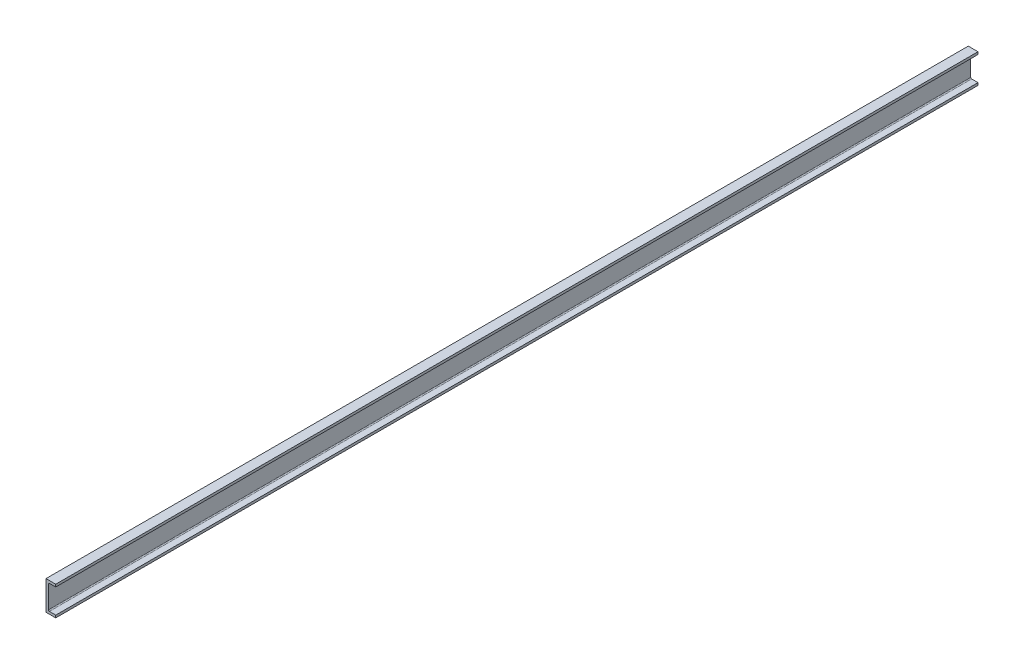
ISO-10303-21;
HEADER;
FILE_DESCRIPTION(('STEP AP214'),'2;1');
FILE_NAME('part.step','',(''),(''),'','','');
FILE_SCHEMA(('AUTOMOTIVE_DESIGN { 1 0 10303 214 1 1 1 1 }'));
ENDSEC;
DATA;
#1=APPLICATION_CONTEXT('core data for automotive mechanical design processes');
#2=APPLICATION_PROTOCOL_DEFINITION('international standard','automotive_design',2000,#1);
#3=PRODUCT_CONTEXT('',#1,'mechanical');
#4=PRODUCT('Part','Part','',(#3));
#5=PRODUCT_RELATED_PRODUCT_CATEGORY('part','',(#4));
#6=PRODUCT_DEFINITION_FORMATION('','',#4);
#7=PRODUCT_DEFINITION_CONTEXT('part definition',#1,'design');
#8=PRODUCT_DEFINITION('design','',#6,#7);
#9=PRODUCT_DEFINITION_SHAPE('','',#8);
#10=(LENGTH_UNIT() NAMED_UNIT(*) SI_UNIT(.MILLI.,.METRE.));
#11=(NAMED_UNIT(*) PLANE_ANGLE_UNIT() SI_UNIT($,.RADIAN.));
#12=(NAMED_UNIT(*) SI_UNIT($,.STERADIAN.) SOLID_ANGLE_UNIT());
#13=UNCERTAINTY_MEASURE_WITH_UNIT(LENGTH_MEASURE(1.E-05),#10,'distance_accuracy_value','');
#14=(GEOMETRIC_REPRESENTATION_CONTEXT(3) GLOBAL_UNCERTAINTY_ASSIGNED_CONTEXT((#13)) GLOBAL_UNIT_ASSIGNED_CONTEXT((#10,
#11,#12)) REPRESENTATION_CONTEXT('',''));
#15=CARTESIAN_POINT('',(0.,0.,0.));
#16=DIRECTION('',(0.,0.,1.));
#17=DIRECTION('',(1.,0.,0.));
#18=AXIS2_PLACEMENT_3D('',#15,#16,#17);
#19=CARTESIAN_POINT('',(25.4,0.,-2406.65));
#20=DIRECTION('',(0.,-1.,0.));
#21=DIRECTION('',(1.,0.,0.));
#22=AXIS2_PLACEMENT_3D('',#19,#20,#21);
#23=PLANE('',#22);
#24=DIRECTION('',(1.,0.,0.));
#25=VECTOR('',#24,1.);
#26=CARTESIAN_POINT('',(25.4,0.,0.));
#27=LINE('',#26,#25);
#28=CARTESIAN_POINT('',(0.,0.,0.));
#29=VERTEX_POINT('',#28);
#30=CARTESIAN_POINT('',(25.4,0.,0.));
#31=VERTEX_POINT('',#30);
#32=EDGE_CURVE('E150',#29,#31,#27,.T.);
#33=ORIENTED_EDGE('',*,*,#32,.F.);
#34=DIRECTION('',(0.,0.,1.));
#35=VECTOR('',#34,1.);
#36=CARTESIAN_POINT('',(0.,0.,-2406.65));
#37=LINE('',#36,#35);
#38=CARTESIAN_POINT('',(0.,0.,-2406.65));
#39=VERTEX_POINT('',#38);
#40=EDGE_CURVE('E130',#39,#29,#37,.T.);
#41=ORIENTED_EDGE('',*,*,#40,.F.);
#42=DIRECTION('',(1.,0.,0.));
#43=VECTOR('',#42,1.);
#44=CARTESIAN_POINT('',(25.4,0.,-2406.65));
#45=LINE('',#44,#43);
#46=CARTESIAN_POINT('',(25.4,0.,-2406.65));
#47=VERTEX_POINT('',#46);
#48=EDGE_CURVE('E125',#39,#47,#45,.T.);
#49=ORIENTED_EDGE('',*,*,#48,.T.);
#50=DIRECTION('',(0.,0.,1.));
#51=VECTOR('',#50,1.);
#52=CARTESIAN_POINT('',(25.4,0.,-2406.65));
#53=LINE('',#52,#51);
#54=EDGE_CURVE('E107',#47,#31,#53,.T.);
#55=ORIENTED_EDGE('',*,*,#54,.T.);
#56=EDGE_LOOP('',(#33,#41,#49,#55));
#57=FACE_BOUND('',#56,.T.);
#58=ADVANCED_FACE('F32',(#57),#23,.T.);
#59=CARTESIAN_POINT('',(0.,0.,-2406.65));
#60=DIRECTION('',(-1.,0.,0.));
#61=DIRECTION('',(0.,0.,1.));
#62=AXIS2_PLACEMENT_3D('',#59,#60,#61);
#63=PLANE('',#62);
#64=DIRECTION('',(0.,-1.,0.));
#65=VECTOR('',#64,1.);
#66=CARTESIAN_POINT('',(0.,0.,0.));
#67=LINE('',#66,#65);
#68=CARTESIAN_POINT('',(0.,76.2,0.));
#69=VERTEX_POINT('',#68);
#70=EDGE_CURVE('E131',#69,#29,#67,.T.);
#71=ORIENTED_EDGE('',*,*,#70,.F.);
#72=DIRECTION('',(0.,0.,1.));
#73=VECTOR('',#72,1.);
#74=CARTESIAN_POINT('',(0.,76.2,-2406.65));
#75=LINE('',#74,#73);
#76=CARTESIAN_POINT('',(0.,76.2,-2406.65));
#77=VERTEX_POINT('',#76);
#78=EDGE_CURVE('E167',#77,#69,#75,.T.);
#79=ORIENTED_EDGE('',*,*,#78,.F.);
#80=DIRECTION('',(0.,-1.,0.));
#81=VECTOR('',#80,1.);
#82=CARTESIAN_POINT('',(0.,0.,-2406.65));
#83=LINE('',#82,#81);
#84=EDGE_CURVE('E118',#77,#39,#83,.T.);
#85=ORIENTED_EDGE('',*,*,#84,.T.);
#86=ORIENTED_EDGE('',*,*,#40,.T.);
#87=EDGE_LOOP('',(#71,#79,#85,#86));
#88=FACE_BOUND('',#87,.T.);
#89=ADVANCED_FACE('F213',(#88),#63,.T.);
#90=CARTESIAN_POINT('',(0.,76.2,-2406.65));
#91=DIRECTION('',(0.,1.,0.));
#92=DIRECTION('',(0.,0.,1.));
#93=AXIS2_PLACEMENT_3D('',#90,#91,#92);
#94=PLANE('',#93);
#95=DIRECTION('',(-1.,0.,0.));
#96=VECTOR('',#95,1.);
#97=CARTESIAN_POINT('',(0.,76.2,0.));
#98=LINE('',#97,#96);
#99=CARTESIAN_POINT('',(25.4,76.2,0.));
#100=VERTEX_POINT('',#99);
#101=EDGE_CURVE('E134',#100,#69,#98,.T.);
#102=ORIENTED_EDGE('',*,*,#101,.F.);
#103=DIRECTION('',(0.,0.,1.));
#104=VECTOR('',#103,1.);
#105=CARTESIAN_POINT('',(25.4,76.2,-2406.65));
#106=LINE('',#105,#104);
#107=CARTESIAN_POINT('',(25.4,76.2,-2406.65));
#108=VERTEX_POINT('',#107);
#109=EDGE_CURVE('E169',#108,#100,#106,.T.);
#110=ORIENTED_EDGE('',*,*,#109,.F.);
#111=DIRECTION('',(-1.,0.,0.));
#112=VECTOR('',#111,1.);
#113=CARTESIAN_POINT('',(0.,76.2,-2406.65));
#114=LINE('',#113,#112);
#115=EDGE_CURVE('E146',#108,#77,#114,.T.);
#116=ORIENTED_EDGE('',*,*,#115,.T.);
#117=ORIENTED_EDGE('',*,*,#78,.T.);
#118=EDGE_LOOP('',(#102,#110,#116,#117));
#119=FACE_BOUND('',#118,.T.);
#120=ADVANCED_FACE('F214',(#119),#94,.T.);
#121=CARTESIAN_POINT('',(25.4,76.2,-2406.65));
#122=DIRECTION('',(1.,0.,0.));
#123=DIRECTION('',(0.,1.,0.));
#124=AXIS2_PLACEMENT_3D('',#121,#122,#123);
#125=PLANE('',#124);
#126=DIRECTION('',(0.,1.,0.));
#127=VECTOR('',#126,1.);
#128=CARTESIAN_POINT('',(25.4,76.2,0.));
#129=LINE('',#128,#127);
#130=CARTESIAN_POINT('',(25.4,69.85,0.));
#131=VERTEX_POINT('',#130);
#132=EDGE_CURVE('E160',#131,#100,#129,.T.);
#133=ORIENTED_EDGE('',*,*,#132,.F.);
#134=DIRECTION('',(0.,0.,1.));
#135=VECTOR('',#134,1.);
#136=CARTESIAN_POINT('',(25.4,69.85,-2406.65));
#137=LINE('',#136,#135);
#138=CARTESIAN_POINT('',(25.4,69.85,-2406.65));
#139=VERTEX_POINT('',#138);
#140=EDGE_CURVE('E171',#139,#131,#137,.T.);
#141=ORIENTED_EDGE('',*,*,#140,.F.);
#142=DIRECTION('',(0.,1.,0.));
#143=VECTOR('',#142,1.);
#144=CARTESIAN_POINT('',(25.4,76.2,-2406.65));
#145=LINE('',#144,#143);
#146=EDGE_CURVE('E143',#139,#108,#145,.T.);
#147=ORIENTED_EDGE('',*,*,#146,.T.);
#148=ORIENTED_EDGE('',*,*,#109,.T.);
#149=EDGE_LOOP('',(#133,#141,#147,#148));
#150=FACE_BOUND('',#149,.T.);
#151=ADVANCED_FACE('F208',(#150),#125,.T.);
#152=CARTESIAN_POINT('',(25.4,69.85,-2406.65));
#153=DIRECTION('',(0.,-1.,0.));
#154=DIRECTION('',(0.,0.,-1.));
#155=AXIS2_PLACEMENT_3D('',#152,#153,#154);
#156=PLANE('',#155);
#157=DIRECTION('',(1.,0.,0.));
#158=VECTOR('',#157,1.);
#159=CARTESIAN_POINT('',(25.4,69.85,0.));
#160=LINE('',#159,#158);
#161=CARTESIAN_POINT('',(8.88999999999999,69.85,0.));
#162=VERTEX_POINT('',#161);
#163=EDGE_CURVE('E158',#162,#131,#160,.T.);
#164=ORIENTED_EDGE('',*,*,#163,.F.);
#165=DIRECTION('',(0.,0.,1.));
#166=VECTOR('',#165,1.);
#167=CARTESIAN_POINT('',(8.88999999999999,69.85,-2406.65));
#168=LINE('',#167,#166);
#169=CARTESIAN_POINT('',(8.88999999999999,69.85,-2406.65));
#170=VERTEX_POINT('',#169);
#171=EDGE_CURVE('E47',#162,#170,#168,.F.);
#172=ORIENTED_EDGE('',*,*,#171,.T.);
#173=DIRECTION('',(1.,0.,0.));
#174=VECTOR('',#173,1.);
#175=CARTESIAN_POINT('',(25.4,69.85,-2406.65));
#176=LINE('',#175,#174);
#177=EDGE_CURVE('E141',#170,#139,#176,.T.);
#178=ORIENTED_EDGE('',*,*,#177,.T.);
#179=ORIENTED_EDGE('',*,*,#140,.T.);
#180=EDGE_LOOP('',(#164,#172,#178,#179));
#181=FACE_BOUND('',#180,.T.);
#182=ADVANCED_FACE('F205',(#181),#156,.T.);
#183=CARTESIAN_POINT('',(6.34999999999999,69.85,-2406.65));
#184=DIRECTION('',(1.,0.,0.));
#185=DIRECTION('',(0.,1.,0.));
#186=AXIS2_PLACEMENT_3D('',#183,#184,#185);
#187=PLANE('',#186);
#188=DIRECTION('',(0.,1.,0.));
#189=VECTOR('',#188,1.);
#190=CARTESIAN_POINT('',(6.34999999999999,69.85,0.));
#191=LINE('',#190,#189);
#192=CARTESIAN_POINT('',(6.35,8.89,0.));
#193=VERTEX_POINT('',#192);
#194=CARTESIAN_POINT('',(6.34999999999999,67.31,0.));
#195=VERTEX_POINT('',#194);
#196=EDGE_CURVE('E156',#193,#195,#191,.T.);
#197=ORIENTED_EDGE('',*,*,#196,.F.);
#198=DIRECTION('',(0.,0.,1.));
#199=VECTOR('',#198,1.);
#200=CARTESIAN_POINT('',(6.35,8.89,-2406.65));
#201=LINE('',#200,#199);
#202=CARTESIAN_POINT('',(6.35,8.89,-2406.65));
#203=VERTEX_POINT('',#202);
#204=EDGE_CURVE('E180',#193,#203,#201,.F.);
#205=ORIENTED_EDGE('',*,*,#204,.T.);
#206=DIRECTION('',(0.,1.,0.));
#207=VECTOR('',#206,1.);
#208=CARTESIAN_POINT('',(6.34999999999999,69.85,-2406.65));
#209=LINE('',#208,#207);
#210=CARTESIAN_POINT('',(6.34999999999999,67.31,-2406.65));
#211=VERTEX_POINT('',#210);
#212=EDGE_CURVE('E138',#203,#211,#209,.T.);
#213=ORIENTED_EDGE('',*,*,#212,.T.);
#214=DIRECTION('',(0.,0.,1.));
#215=VECTOR('',#214,1.);
#216=CARTESIAN_POINT('',(6.34999999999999,67.31,0.));
#217=LINE('',#216,#215);
#218=EDGE_CURVE('E177',#211,#195,#217,.T.);
#219=ORIENTED_EDGE('',*,*,#218,.T.);
#220=EDGE_LOOP('',(#197,#205,#213,#219));
#221=FACE_BOUND('',#220,.T.);
#222=ADVANCED_FACE('F198',(#221),#187,.T.);
#223=CARTESIAN_POINT('',(6.35,6.35,-2406.65));
#224=DIRECTION('',(0.,1.,0.));
#225=DIRECTION('',(-1.,0.,0.));
#226=AXIS2_PLACEMENT_3D('',#223,#224,#225);
#227=PLANE('',#226);
#228=DIRECTION('',(-1.,0.,0.));
#229=VECTOR('',#228,1.);
#230=CARTESIAN_POINT('',(6.35,6.35,-2406.65));
#231=LINE('',#230,#229);
#232=CARTESIAN_POINT('',(25.4,6.35,-2406.65));
#233=VERTEX_POINT('',#232);
#234=CARTESIAN_POINT('',(8.89,6.35,-2406.65));
#235=VERTEX_POINT('',#234);
#236=EDGE_CURVE('E128',#233,#235,#231,.T.);
#237=ORIENTED_EDGE('',*,*,#236,.T.);
#238=DIRECTION('',(0.,0.,1.));
#239=VECTOR('',#238,1.);
#240=CARTESIAN_POINT('',(8.89,6.35,0.));
#241=LINE('',#240,#239);
#242=CARTESIAN_POINT('',(8.89,6.35,0.));
#243=VERTEX_POINT('',#242);
#244=EDGE_CURVE('E166',#235,#243,#241,.T.);
#245=ORIENTED_EDGE('',*,*,#244,.T.);
#246=DIRECTION('',(-1.,0.,0.));
#247=VECTOR('',#246,1.);
#248=CARTESIAN_POINT('',(6.35,6.35,0.));
#249=LINE('',#248,#247);
#250=CARTESIAN_POINT('',(25.4,6.35,0.));
#251=VERTEX_POINT('',#250);
#252=EDGE_CURVE('E153',#251,#243,#249,.T.);
#253=ORIENTED_EDGE('',*,*,#252,.F.);
#254=DIRECTION('',(0.,0.,1.));
#255=VECTOR('',#254,1.);
#256=CARTESIAN_POINT('',(25.4,6.35,-2406.65));
#257=LINE('',#256,#255);
#258=EDGE_CURVE('E117',#233,#251,#257,.T.);
#259=ORIENTED_EDGE('',*,*,#258,.F.);
#260=EDGE_LOOP('',(#237,#245,#253,#259));
#261=FACE_BOUND('',#260,.T.);
#262=ADVANCED_FACE('F192',(#261),#227,.T.);
#263=CARTESIAN_POINT('',(25.4,6.35,-2406.65));
#264=DIRECTION('',(1.,0.,0.));
#265=DIRECTION('',(0.,0.,-1.));
#266=AXIS2_PLACEMENT_3D('',#263,#264,#265);
#267=PLANE('',#266);
#268=DIRECTION('',(0.,1.,0.));
#269=VECTOR('',#268,1.);
#270=CARTESIAN_POINT('',(25.4,6.35,0.));
#271=LINE('',#270,#269);
#272=EDGE_CURVE('E112',#31,#251,#271,.T.);
#273=ORIENTED_EDGE('',*,*,#272,.F.);
#274=ORIENTED_EDGE('',*,*,#54,.F.);
#275=DIRECTION('',(0.,1.,0.));
#276=VECTOR('',#275,1.);
#277=CARTESIAN_POINT('',(25.4,6.35,-2406.65));
#278=LINE('',#277,#276);
#279=EDGE_CURVE('E110',#47,#233,#278,.T.);
#280=ORIENTED_EDGE('',*,*,#279,.T.);
#281=ORIENTED_EDGE('',*,*,#258,.T.);
#282=EDGE_LOOP('',(#273,#274,#280,#281));
#283=FACE_BOUND('',#282,.T.);
#284=ADVANCED_FACE('F109',(#283),#267,.T.);
#285=CARTESIAN_POINT('',(0.,0.,-2406.65));
#286=DIRECTION('',(0.,0.,-1.));
#287=DIRECTION('',(-1.,0.,0.));
#288=AXIS2_PLACEMENT_3D('',#285,#286,#287);
#289=PLANE('',#288);
#290=ORIENTED_EDGE('',*,*,#48,.F.);
#291=ORIENTED_EDGE('',*,*,#84,.F.);
#292=ORIENTED_EDGE('',*,*,#115,.F.);
#293=ORIENTED_EDGE('',*,*,#146,.F.);
#294=ORIENTED_EDGE('',*,*,#177,.F.);
#295=CARTESIAN_POINT('',(8.88999999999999,67.31,-2406.65));
#296=DIRECTION('',(0.,0.,-1.));
#297=DIRECTION('',(-1.,0.,0.));
#298=AXIS2_PLACEMENT_3D('',#295,#296,#297);
#299=CIRCLE('',#298,2.54);
#300=EDGE_CURVE('E11',#170,#211,#299,.F.);
#301=ORIENTED_EDGE('',*,*,#300,.T.);
#302=ORIENTED_EDGE('',*,*,#212,.F.);
#303=CARTESIAN_POINT('',(8.89,8.89,-2406.65));
#304=DIRECTION('',(0.,0.,-1.));
#305=DIRECTION('',(-1.,0.,0.));
#306=AXIS2_PLACEMENT_3D('',#303,#304,#305);
#307=CIRCLE('',#306,2.54);
#308=EDGE_CURVE('E185',#203,#235,#307,.F.);
#309=ORIENTED_EDGE('',*,*,#308,.T.);
#310=ORIENTED_EDGE('',*,*,#236,.F.);
#311=ORIENTED_EDGE('',*,*,#279,.F.);
#312=EDGE_LOOP('',(#290,#291,#292,#293,#294,#301,#302,#309,#310,#311));
#313=FACE_BOUND('',#312,.T.);
#314=ADVANCED_FACE('F123',(#313),#289,.T.);
#315=CARTESIAN_POINT('',(0.,0.,0.));
#316=DIRECTION('',(0.,0.,-1.));
#317=DIRECTION('',(-1.,0.,0.));
#318=AXIS2_PLACEMENT_3D('',#315,#316,#317);
#319=PLANE('',#318);
#320=ORIENTED_EDGE('',*,*,#32,.T.);
#321=ORIENTED_EDGE('',*,*,#272,.T.);
#322=ORIENTED_EDGE('',*,*,#252,.T.);
#323=CARTESIAN_POINT('',(8.89,8.89,0.));
#324=DIRECTION('',(0.,0.,-1.));
#325=DIRECTION('',(-1.,0.,0.));
#326=AXIS2_PLACEMENT_3D('',#323,#324,#325);
#327=CIRCLE('',#326,2.54);
#328=EDGE_CURVE('E183',#243,#193,#327,.T.);
#329=ORIENTED_EDGE('',*,*,#328,.T.);
#330=ORIENTED_EDGE('',*,*,#196,.T.);
#331=CARTESIAN_POINT('',(8.88999999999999,67.31,0.));
#332=DIRECTION('',(0.,0.,-1.));
#333=DIRECTION('',(-1.,0.,0.));
#334=AXIS2_PLACEMENT_3D('',#331,#332,#333);
#335=CIRCLE('',#334,2.54);
#336=EDGE_CURVE('E40',#195,#162,#335,.T.);
#337=ORIENTED_EDGE('',*,*,#336,.T.);
#338=ORIENTED_EDGE('',*,*,#163,.T.);
#339=ORIENTED_EDGE('',*,*,#132,.T.);
#340=ORIENTED_EDGE('',*,*,#101,.T.);
#341=ORIENTED_EDGE('',*,*,#70,.T.);
#342=EDGE_LOOP('',(#320,#321,#322,#329,#330,#337,#338,#339,#340,#341));
#343=FACE_BOUND('',#342,.T.);
#344=ADVANCED_FACE('F196',(#343),#319,.F.);
#345=CARTESIAN_POINT('',(8.89,8.89,-2406.65));
#346=DIRECTION('',(0.,0.,-1.));
#347=DIRECTION('',(-1.,0.,0.));
#348=AXIS2_PLACEMENT_3D('',#345,#346,#347);
#349=CYLINDRICAL_SURFACE('',#348,2.54);
#350=ORIENTED_EDGE('',*,*,#308,.F.);
#351=ORIENTED_EDGE('',*,*,#204,.F.);
#352=ORIENTED_EDGE('',*,*,#328,.F.);
#353=ORIENTED_EDGE('',*,*,#244,.F.);
#354=EDGE_LOOP('',(#350,#351,#352,#353));
#355=FACE_BOUND('',#354,.T.);
#356=ADVANCED_FACE('F194',(#355),#349,.F.);
#357=CARTESIAN_POINT('',(8.88999999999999,67.31,-2406.65));
#358=DIRECTION('',(0.,0.,-1.));
#359=DIRECTION('',(-1.,0.,0.));
#360=AXIS2_PLACEMENT_3D('',#357,#358,#359);
#361=CYLINDRICAL_SURFACE('',#360,2.54);
#362=ORIENTED_EDGE('',*,*,#300,.F.);
#363=ORIENTED_EDGE('',*,*,#171,.F.);
#364=ORIENTED_EDGE('',*,*,#336,.F.);
#365=ORIENTED_EDGE('',*,*,#218,.F.);
#366=EDGE_LOOP('',(#362,#363,#364,#365));
#367=FACE_BOUND('',#366,.T.);
#368=ADVANCED_FACE('F34',(#367),#361,.F.);
#369=CLOSED_SHELL('',(#58,#89,#120,#151,#182,#222,#262,#284,#314,#344,#356,#368));
#370=MANIFOLD_SOLID_BREP('B2',#369);
#371=ADVANCED_BREP_SHAPE_REPRESENTATION('',(#18,#370),#14);
#372=SHAPE_DEFINITION_REPRESENTATION(#9,#371);
ENDSEC;
END-ISO-10303-21;
